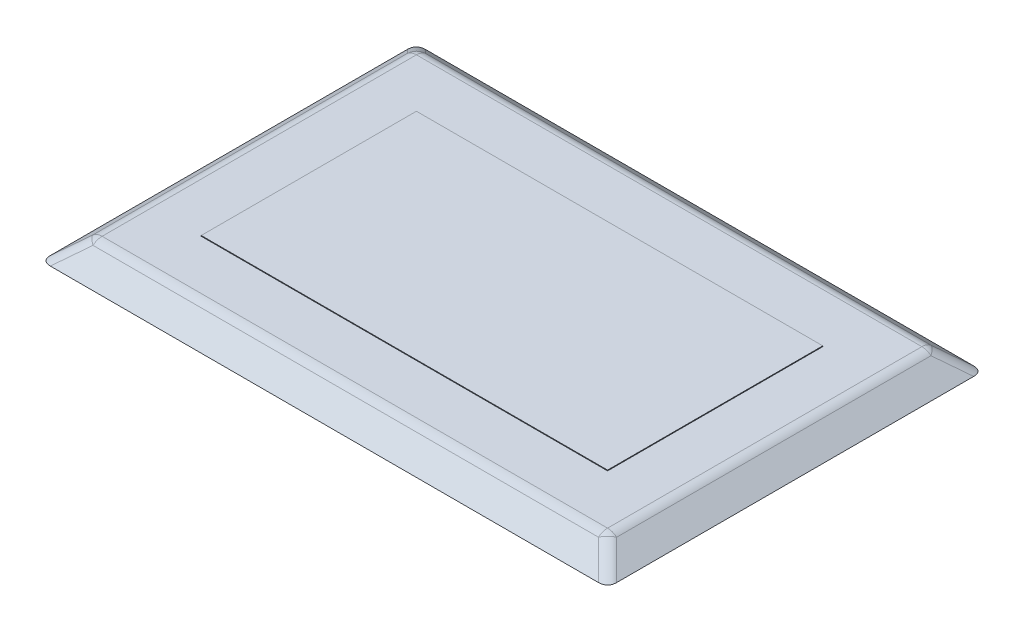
ISO-10303-21;
HEADER;
FILE_DESCRIPTION(('STEP AP214'),'2;1');
FILE_NAME('part.step','',(''),(''),'','','');
FILE_SCHEMA(('AUTOMOTIVE_DESIGN { 1 0 10303 214 1 1 1 1 }'));
ENDSEC;
DATA;
#1=APPLICATION_CONTEXT('core data for automotive mechanical design processes');
#2=APPLICATION_PROTOCOL_DEFINITION('international standard','automotive_design',2000,#1);
#3=PRODUCT_CONTEXT('',#1,'mechanical');
#4=PRODUCT('Part','Part','',(#3));
#5=PRODUCT_RELATED_PRODUCT_CATEGORY('part','',(#4));
#6=PRODUCT_DEFINITION_FORMATION('','',#4);
#7=PRODUCT_DEFINITION_CONTEXT('part definition',#1,'design');
#8=PRODUCT_DEFINITION('design','',#6,#7);
#9=PRODUCT_DEFINITION_SHAPE('','',#8);
#10=(LENGTH_UNIT() NAMED_UNIT(*) SI_UNIT(.MILLI.,.METRE.));
#11=(NAMED_UNIT(*) PLANE_ANGLE_UNIT() SI_UNIT($,.RADIAN.));
#12=(NAMED_UNIT(*) SI_UNIT($,.STERADIAN.) SOLID_ANGLE_UNIT());
#13=UNCERTAINTY_MEASURE_WITH_UNIT(LENGTH_MEASURE(1.E-05),#10,'distance_accuracy_value','');
#14=(GEOMETRIC_REPRESENTATION_CONTEXT(3) GLOBAL_UNCERTAINTY_ASSIGNED_CONTEXT((#13)) GLOBAL_UNIT_ASSIGNED_CONTEXT((#10,
#11,#12)) REPRESENTATION_CONTEXT('',''));
#15=CARTESIAN_POINT('',(0.,0.,0.));
#16=DIRECTION('',(0.,0.,1.));
#17=DIRECTION('',(1.,0.,0.));
#18=AXIS2_PLACEMENT_3D('',#15,#16,#17);
#19=CARTESIAN_POINT('',(0.,3.,0.));
#20=DIRECTION('',(0.,1.,0.));
#21=DIRECTION('',(0.,0.,1.));
#22=AXIS2_PLACEMENT_3D('',#19,#20,#21);
#23=PLANE('',#22);
#24=DIRECTION('',(0.,0.,1.));
#25=VECTOR('',#24,1.);
#26=CARTESIAN_POINT('',(-35.696798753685,3.,0.));
#27=LINE('',#26,#25);
#28=CARTESIAN_POINT('',(-35.696798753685,3.,-22.196798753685));
#29=VERTEX_POINT('',#28);
#30=CARTESIAN_POINT('',(-35.696798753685,3.,22.196798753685));
#31=VERTEX_POINT('',#30);
#32=EDGE_CURVE('E179',#29,#31,#27,.T.);
#33=ORIENTED_EDGE('',*,*,#32,.T.);
#34=DIRECTION('',(1.,0.,0.));
#35=VECTOR('',#34,1.);
#36=CARTESIAN_POINT('',(0.,3.,22.196798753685));
#37=LINE('',#36,#35);
#38=CARTESIAN_POINT('',(35.696798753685,3.,22.196798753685));
#39=VERTEX_POINT('',#38);
#40=EDGE_CURVE('E185',#31,#39,#37,.T.);
#41=ORIENTED_EDGE('',*,*,#40,.T.);
#42=DIRECTION('',(0.,0.,-1.));
#43=VECTOR('',#42,1.);
#44=CARTESIAN_POINT('',(35.696798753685,3.,0.));
#45=LINE('',#44,#43);
#46=CARTESIAN_POINT('',(35.696798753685,3.,-22.196798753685));
#47=VERTEX_POINT('',#46);
#48=EDGE_CURVE('E183',#39,#47,#45,.T.);
#49=ORIENTED_EDGE('',*,*,#48,.T.);
#50=DIRECTION('',(-1.,0.,0.));
#51=VECTOR('',#50,1.);
#52=CARTESIAN_POINT('',(0.,3.,-22.196798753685));
#53=LINE('',#52,#51);
#54=EDGE_CURVE('E181',#47,#29,#53,.T.);
#55=ORIENTED_EDGE('',*,*,#54,.T.);
#56=EDGE_LOOP('',(#33,#41,#49,#55));
#57=FACE_BOUND('',#56,.T.);
#58=DIRECTION('',(-1.,0.,0.));
#59=VECTOR('',#58,1.);
#60=CARTESIAN_POINT('',(-28.696798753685,3.,-15.196798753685));
#61=LINE('',#60,#59);
#62=CARTESIAN_POINT('',(28.696798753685,3.,-15.196798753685));
#63=VERTEX_POINT('',#62);
#64=CARTESIAN_POINT('',(-28.696798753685,3.,-15.196798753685));
#65=VERTEX_POINT('',#64);
#66=EDGE_CURVE('E503',#63,#65,#61,.T.);
#67=ORIENTED_EDGE('',*,*,#66,.F.);
#68=DIRECTION('',(0.,0.,-1.));
#69=VECTOR('',#68,1.);
#70=CARTESIAN_POINT('',(28.696798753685,3.,-15.196798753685));
#71=LINE('',#70,#69);
#72=CARTESIAN_POINT('',(28.696798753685,3.,15.196798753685));
#73=VERTEX_POINT('',#72);
#74=EDGE_CURVE('E158',#73,#63,#71,.T.);
#75=ORIENTED_EDGE('',*,*,#74,.F.);
#76=DIRECTION('',(1.,0.,0.));
#77=VECTOR('',#76,1.);
#78=CARTESIAN_POINT('',(-28.696798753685,3.,15.196798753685));
#79=LINE('',#78,#77);
#80=CARTESIAN_POINT('',(-28.696798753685,3.,15.196798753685));
#81=VERTEX_POINT('',#80);
#82=EDGE_CURVE('E154',#81,#73,#79,.T.);
#83=ORIENTED_EDGE('',*,*,#82,.F.);
#84=DIRECTION('',(0.,0.,1.));
#85=VECTOR('',#84,1.);
#86=CARTESIAN_POINT('',(-28.696798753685,3.,-15.196798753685));
#87=LINE('',#86,#85);
#88=EDGE_CURVE('E500',#65,#81,#87,.T.);
#89=ORIENTED_EDGE('',*,*,#88,.F.);
#90=EDGE_LOOP('',(#67,#75,#83,#89));
#91=FACE_BOUND('',#90,.T.);
#92=ADVANCED_FACE('F33',(#57,#91),#23,.T.);
#93=CARTESIAN_POINT('',(0.,0.,0.));
#94=DIRECTION('',(0.,1.,0.));
#95=DIRECTION('',(0.,0.,1.));
#96=AXIS2_PLACEMENT_3D('',#93,#94,#95);
#97=PLANE('',#96);
#98=DIRECTION('',(0.,0.,1.));
#99=VECTOR('',#98,1.);
#100=CARTESIAN_POINT('',(-40.,0.,-26.5));
#101=LINE('',#100,#99);
#102=CARTESIAN_POINT('',(-40.,0.,-25.2144247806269));
#103=VERTEX_POINT('',#102);
#104=CARTESIAN_POINT('',(-40.,0.,25.2144247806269));
#105=VERTEX_POINT('',#104);
#106=EDGE_CURVE('E173',#103,#105,#101,.T.);
#107=ORIENTED_EDGE('',*,*,#106,.F.);
#108=CARTESIAN_POINT('',(-36.8885523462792,0.,-23.3885523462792));
#109=DIRECTION('',(0.,1.,0.));
#110=DIRECTION('',(-0.707106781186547,0.,-0.707106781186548));
#111=AXIS2_PLACEMENT_3D('',#108,#109,#110);
#112=ELLIPSE('',#111,3.91946590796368,2.);
#113=CARTESIAN_POINT('',(-38.7144247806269,0.,-26.5));
#114=VERTEX_POINT('',#113);
#115=EDGE_CURVE('E11',#103,#114,#112,.F.);
#116=ORIENTED_EDGE('',*,*,#115,.T.);
#117=DIRECTION('',(-1.,0.,0.));
#118=VECTOR('',#117,1.);
#119=CARTESIAN_POINT('',(-40.,0.,-26.5));
#120=LINE('',#119,#118);
#121=CARTESIAN_POINT('',(38.7144247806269,0.,-26.5));
#122=VERTEX_POINT('',#121);
#123=EDGE_CURVE('E170',#122,#114,#120,.T.);
#124=ORIENTED_EDGE('',*,*,#123,.F.);
#125=CARTESIAN_POINT('',(36.8885523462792,0.,-23.3885523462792));
#126=DIRECTION('',(0.,1.,0.));
#127=DIRECTION('',(0.707106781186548,0.,-0.707106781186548));
#128=AXIS2_PLACEMENT_3D('',#125,#126,#127);
#129=ELLIPSE('',#128,3.91946590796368,2.);
#130=CARTESIAN_POINT('',(40.,0.,-25.2144247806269));
#131=VERTEX_POINT('',#130);
#132=EDGE_CURVE('E214',#122,#131,#129,.F.);
#133=ORIENTED_EDGE('',*,*,#132,.T.);
#134=DIRECTION('',(0.,0.,-1.));
#135=VECTOR('',#134,1.);
#136=CARTESIAN_POINT('',(40.,0.,-26.5));
#137=LINE('',#136,#135);
#138=CARTESIAN_POINT('',(40.,0.,25.2144247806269));
#139=VERTEX_POINT('',#138);
#140=EDGE_CURVE('E167',#139,#131,#137,.T.);
#141=ORIENTED_EDGE('',*,*,#140,.F.);
#142=CARTESIAN_POINT('',(36.8885523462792,0.,23.3885523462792));
#143=DIRECTION('',(0.,1.,0.));
#144=DIRECTION('',(-0.707106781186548,0.,-0.707106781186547));
#145=AXIS2_PLACEMENT_3D('',#142,#143,#144);
#146=ELLIPSE('',#145,3.91946590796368,2.);
#147=CARTESIAN_POINT('',(38.7144247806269,0.,26.5));
#148=VERTEX_POINT('',#147);
#149=EDGE_CURVE('E212',#139,#148,#146,.F.);
#150=ORIENTED_EDGE('',*,*,#149,.T.);
#151=DIRECTION('',(1.,0.,0.));
#152=VECTOR('',#151,1.);
#153=CARTESIAN_POINT('',(-40.,0.,26.5));
#154=LINE('',#153,#152);
#155=CARTESIAN_POINT('',(-38.7144247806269,0.,26.5));
#156=VERTEX_POINT('',#155);
#157=EDGE_CURVE('E176',#156,#148,#154,.T.);
#158=ORIENTED_EDGE('',*,*,#157,.F.);
#159=CARTESIAN_POINT('',(-36.8885523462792,0.,23.3885523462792));
#160=DIRECTION('',(0.,1.,0.));
#161=DIRECTION('',(0.707106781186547,0.,-0.707106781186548));
#162=AXIS2_PLACEMENT_3D('',#159,#160,#161);
#163=ELLIPSE('',#162,3.91946590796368,2.);
#164=EDGE_CURVE('E42',#156,#105,#163,.F.);
#165=ORIENTED_EDGE('',*,*,#164,.T.);
#166=EDGE_LOOP('',(#107,#116,#124,#133,#141,#150,#158,#165));
#167=FACE_BOUND('',#166,.T.);
#168=ADVANCED_FACE('F279',(#167),#97,.F.);
#169=CARTESIAN_POINT('',(36.4247392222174,3.,0.));
#170=DIRECTION('',(0.642787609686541,0.766044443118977,0.));
#171=DIRECTION('',(0.,0.,1.));
#172=AXIS2_PLACEMENT_3D('',#169,#170,#171);
#173=PLANE('',#172);
#174=ORIENTED_EDGE('',*,*,#140,.T.);
#175=DIRECTION('',(0.608120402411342,-0.510273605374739,-0.608120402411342));
#176=VECTOR('',#175,1.);
#177=CARTESIAN_POINT('',(28.4223508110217,9.71480116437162,-13.6367755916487));
#178=LINE('',#177,#176);
#179=CARTESIAN_POINT('',(36.982373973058,2.53208888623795,-22.196798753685));
#180=VERTEX_POINT('',#179);
#181=EDGE_CURVE('E199',#131,#180,#178,.F.);
#182=ORIENTED_EDGE('',*,*,#181,.T.);
#183=DIRECTION('',(0.,0.,-1.));
#184=VECTOR('',#183,1.);
#185=CARTESIAN_POINT('',(36.9823739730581,2.53208888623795,0.));
#186=LINE('',#185,#184);
#187=CARTESIAN_POINT('',(36.9823739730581,2.53208888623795,22.196798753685));
#188=VERTEX_POINT('',#187);
#189=EDGE_CURVE('E197',#180,#188,#186,.F.);
#190=ORIENTED_EDGE('',*,*,#189,.T.);
#191=DIRECTION('',(-0.608120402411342,0.510273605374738,-0.608120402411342));
#192=VECTOR('',#191,1.);
#193=CARTESIAN_POINT('',(28.4223508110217,9.71480116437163,13.6367755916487));
#194=LINE('',#193,#192);
#195=EDGE_CURVE('E195',#188,#139,#194,.F.);
#196=ORIENTED_EDGE('',*,*,#195,.T.);
#197=EDGE_LOOP('',(#174,#182,#190,#196));
#198=FACE_BOUND('',#197,.T.);
#199=ADVANCED_FACE('F282',(#198),#173,.T.);
#200=CARTESIAN_POINT('',(0.,3.,-22.9247392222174));
#201=DIRECTION('',(0.,0.766044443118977,-0.642787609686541));
#202=DIRECTION('',(1.,0.,0.));
#203=AXIS2_PLACEMENT_3D('',#200,#201,#202);
#204=PLANE('',#203);
#205=ORIENTED_EDGE('',*,*,#123,.T.);
#206=DIRECTION('',(-0.608120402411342,-0.510273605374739,-0.608120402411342));
#207=VECTOR('',#206,1.);
#208=CARTESIAN_POINT('',(-22.1443348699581,13.9039563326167,-9.92991008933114));
#209=LINE('',#208,#207);
#210=CARTESIAN_POINT('',(-35.696798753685,2.53208888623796,-23.482373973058));
#211=VERTEX_POINT('',#210);
#212=EDGE_CURVE('E205',#114,#211,#209,.F.);
#213=ORIENTED_EDGE('',*,*,#212,.T.);
#214=DIRECTION('',(-1.,0.,0.));
#215=VECTOR('',#214,1.);
#216=CARTESIAN_POINT('',(0.,2.53208888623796,-23.482373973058));
#217=LINE('',#216,#215);
#218=CARTESIAN_POINT('',(35.696798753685,2.53208888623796,-23.482373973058));
#219=VERTEX_POINT('',#218);
#220=EDGE_CURVE('E203',#211,#219,#217,.F.);
#221=ORIENTED_EDGE('',*,*,#220,.T.);
#222=DIRECTION('',(0.608120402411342,-0.510273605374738,-0.608120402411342));
#223=VECTOR('',#222,1.);
#224=CARTESIAN_POINT('',(22.1443348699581,13.9039563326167,-9.92991008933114));
#225=LINE('',#224,#223);
#226=EDGE_CURVE('E201',#219,#122,#225,.T.);
#227=ORIENTED_EDGE('',*,*,#226,.T.);
#228=EDGE_LOOP('',(#205,#213,#221,#227));
#229=FACE_BOUND('',#228,.T.);
#230=ADVANCED_FACE('F268',(#229),#204,.T.);
#231=CARTESIAN_POINT('',(0.,3.,22.9247392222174));
#232=DIRECTION('',(0.,0.766044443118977,0.642787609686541));
#233=DIRECTION('',(-1.,0.,0.));
#234=AXIS2_PLACEMENT_3D('',#231,#232,#233);
#235=PLANE('',#234);
#236=DIRECTION('',(1.,0.,0.));
#237=VECTOR('',#236,1.);
#238=CARTESIAN_POINT('',(0.,2.53208888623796,23.482373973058));
#239=LINE('',#238,#237);
#240=CARTESIAN_POINT('',(35.696798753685,2.53208888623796,23.482373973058));
#241=VERTEX_POINT('',#240);
#242=CARTESIAN_POINT('',(-35.696798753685,2.53208888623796,23.482373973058));
#243=VERTEX_POINT('',#242);
#244=EDGE_CURVE('E190',#241,#243,#239,.F.);
#245=ORIENTED_EDGE('',*,*,#244,.T.);
#246=DIRECTION('',(0.608120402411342,0.510273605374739,-0.608120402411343));
#247=VECTOR('',#246,1.);
#248=CARTESIAN_POINT('',(-22.1443348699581,13.9039563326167,9.92991008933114));
#249=LINE('',#248,#247);
#250=EDGE_CURVE('E193',#243,#156,#249,.F.);
#251=ORIENTED_EDGE('',*,*,#250,.T.);
#252=ORIENTED_EDGE('',*,*,#157,.T.);
#253=DIRECTION('',(-0.608120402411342,0.510273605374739,-0.608120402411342));
#254=VECTOR('',#253,1.);
#255=CARTESIAN_POINT('',(22.1443348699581,13.9039563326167,9.92991008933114));
#256=LINE('',#255,#254);
#257=EDGE_CURVE('E188',#148,#241,#256,.T.);
#258=ORIENTED_EDGE('',*,*,#257,.T.);
#259=EDGE_LOOP('',(#245,#251,#252,#258));
#260=FACE_BOUND('',#259,.T.);
#261=ADVANCED_FACE('F299',(#260),#235,.T.);
#262=CARTESIAN_POINT('',(-36.4247392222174,3.,0.));
#263=DIRECTION('',(-0.642787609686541,0.766044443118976,0.));
#264=DIRECTION('',(0.,0.,-1.));
#265=AXIS2_PLACEMENT_3D('',#262,#263,#264);
#266=PLANE('',#265);
#267=DIRECTION('',(0.,0.,1.));
#268=VECTOR('',#267,1.);
#269=CARTESIAN_POINT('',(-36.9823739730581,2.53208888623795,0.));
#270=LINE('',#269,#268);
#271=CARTESIAN_POINT('',(-36.9823739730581,2.53208888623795,22.196798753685));
#272=VERTEX_POINT('',#271);
#273=CARTESIAN_POINT('',(-36.9823739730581,2.53208888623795,-22.196798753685));
#274=VERTEX_POINT('',#273);
#275=EDGE_CURVE('E58',#272,#274,#270,.F.);
#276=ORIENTED_EDGE('',*,*,#275,.T.);
#277=DIRECTION('',(-0.608120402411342,-0.510273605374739,-0.608120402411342));
#278=VECTOR('',#277,1.);
#279=CARTESIAN_POINT('',(-28.4223508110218,9.71480116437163,-13.6367755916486));
#280=LINE('',#279,#278);
#281=EDGE_CURVE('E210',#274,#103,#280,.T.);
#282=ORIENTED_EDGE('',*,*,#281,.T.);
#283=ORIENTED_EDGE('',*,*,#106,.T.);
#284=DIRECTION('',(0.608120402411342,0.510273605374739,-0.608120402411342));
#285=VECTOR('',#284,1.);
#286=CARTESIAN_POINT('',(-28.4223508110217,9.71480116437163,13.6367755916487));
#287=LINE('',#286,#285);
#288=EDGE_CURVE('E207',#105,#272,#287,.T.);
#289=ORIENTED_EDGE('',*,*,#288,.T.);
#290=EDGE_LOOP('',(#276,#282,#283,#289));
#291=FACE_BOUND('',#290,.T.);
#292=ADVANCED_FACE('F306',(#291),#266,.T.);
#293=CARTESIAN_POINT('',(-27.1367755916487,8.18271227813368,-13.6367755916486));
#294=DIRECTION('',(-0.608120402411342,-0.510273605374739,-0.608120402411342));
#295=DIRECTION('',(-0.707106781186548,0.,0.707106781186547));
#296=AXIS2_PLACEMENT_3D('',#293,#294,#295);
#297=CYLINDRICAL_SURFACE('',#296,2.);
#298=ORIENTED_EDGE('',*,*,#115,.F.);
#299=ORIENTED_EDGE('',*,*,#281,.F.);
#300=CARTESIAN_POINT('',(-35.696798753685,1.,-22.196798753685));
#301=DIRECTION('',(0.608120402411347,0.510273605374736,0.608120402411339));
#302=DIRECTION('',(0.707106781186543,0.,-0.707106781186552));
#303=AXIS2_PLACEMENT_3D('',#300,#301,#302);
#304=CIRCLE('',#303,2.);
#305=EDGE_CURVE('E37',#211,#274,#304,.T.);
#306=ORIENTED_EDGE('',*,*,#305,.F.);
#307=ORIENTED_EDGE('',*,*,#212,.F.);
#308=EDGE_LOOP('',(#298,#299,#306,#307));
#309=FACE_BOUND('',#308,.T.);
#310=ADVANCED_FACE('F35',(#309),#297,.T.);
#311=CARTESIAN_POINT('',(0.,1.,-22.196798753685));
#312=DIRECTION('',(-1.,0.,0.));
#313=DIRECTION('',(0.,0.,1.));
#314=AXIS2_PLACEMENT_3D('',#311,#312,#313);
#315=CYLINDRICAL_SURFACE('',#314,2.);
#316=CARTESIAN_POINT('',(35.696798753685,1.,-22.196798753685));
#317=DIRECTION('',(1.,0.,0.));
#318=DIRECTION('',(0.,0.,-1.));
#319=AXIS2_PLACEMENT_3D('',#316,#317,#318);
#320=CIRCLE('',#319,2.);
#321=EDGE_CURVE('E239',#219,#47,#320,.T.);
#322=ORIENTED_EDGE('',*,*,#321,.F.);
#323=ORIENTED_EDGE('',*,*,#220,.F.);
#324=CARTESIAN_POINT('',(-35.696798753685,1.,-22.196798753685));
#325=DIRECTION('',(-1.,0.,0.));
#326=DIRECTION('',(0.,0.,1.));
#327=AXIS2_PLACEMENT_3D('',#324,#325,#326);
#328=CIRCLE('',#327,2.);
#329=EDGE_CURVE('E241',#29,#211,#328,.T.);
#330=ORIENTED_EDGE('',*,*,#329,.F.);
#331=ORIENTED_EDGE('',*,*,#54,.F.);
#332=EDGE_LOOP('',(#322,#323,#330,#331));
#333=FACE_BOUND('',#332,.T.);
#334=ADVANCED_FACE('F265',(#333),#315,.T.);
#335=CARTESIAN_POINT('',(22.1443348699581,12.3718674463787,-8.64433486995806));
#336=DIRECTION('',(0.608120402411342,-0.510273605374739,-0.608120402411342));
#337=DIRECTION('',(-0.707106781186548,0.,-0.707106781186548));
#338=AXIS2_PLACEMENT_3D('',#335,#336,#337);
#339=CYLINDRICAL_SURFACE('',#338,2.);
#340=ORIENTED_EDGE('',*,*,#132,.F.);
#341=ORIENTED_EDGE('',*,*,#226,.F.);
#342=CARTESIAN_POINT('',(35.696798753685,0.999999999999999,-22.196798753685));
#343=DIRECTION('',(-0.608120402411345,0.510273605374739,0.608120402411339));
#344=DIRECTION('',(0.707106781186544,0.,0.707106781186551));
#345=AXIS2_PLACEMENT_3D('',#342,#343,#344);
#346=CIRCLE('',#345,2.);
#347=EDGE_CURVE('E236',#180,#219,#346,.T.);
#348=ORIENTED_EDGE('',*,*,#347,.F.);
#349=ORIENTED_EDGE('',*,*,#181,.F.);
#350=EDGE_LOOP('',(#340,#341,#348,#349));
#351=FACE_BOUND('',#350,.T.);
#352=ADVANCED_FACE('F273',(#351),#339,.T.);
#353=CARTESIAN_POINT('',(-35.696798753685,1.,-22.196798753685));
#354=DIRECTION('',(0.,0.,1.));
#355=DIRECTION('',(1.,0.,0.));
#356=AXIS2_PLACEMENT_3D('',#353,#354,#355);
#357=SPHERICAL_SURFACE('',#356,2.);
#358=ORIENTED_EDGE('',*,*,#329,.T.);
#359=ORIENTED_EDGE('',*,*,#305,.T.);
#360=CARTESIAN_POINT('',(-35.696798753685,1.,-22.196798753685));
#361=DIRECTION('',(0.,0.,-1.));
#362=DIRECTION('',(-1.,0.,0.));
#363=AXIS2_PLACEMENT_3D('',#360,#361,#362);
#364=CIRCLE('',#363,2.);
#365=EDGE_CURVE('E233',#29,#274,#364,.F.);
#366=ORIENTED_EDGE('',*,*,#365,.F.);
#367=EDGE_LOOP('',(#358,#359,#366));
#368=FACE_BOUND('',#367,.T.);
#369=ADVANCED_FACE('F248',(#368),#357,.T.);
#370=CARTESIAN_POINT('',(35.696798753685,1.,-22.196798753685));
#371=DIRECTION('',(0.,0.,1.));
#372=DIRECTION('',(1.,0.,0.));
#373=AXIS2_PLACEMENT_3D('',#370,#371,#372);
#374=SPHERICAL_SURFACE('',#373,2.);
#375=ORIENTED_EDGE('',*,*,#347,.T.);
#376=ORIENTED_EDGE('',*,*,#321,.T.);
#377=CARTESIAN_POINT('',(35.696798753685,1.,-22.196798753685));
#378=DIRECTION('',(0.,0.,-1.));
#379=DIRECTION('',(-1.,0.,0.));
#380=AXIS2_PLACEMENT_3D('',#377,#378,#379);
#381=CIRCLE('',#380,2.);
#382=EDGE_CURVE('E230',#180,#47,#381,.F.);
#383=ORIENTED_EDGE('',*,*,#382,.F.);
#384=EDGE_LOOP('',(#375,#376,#383));
#385=FACE_BOUND('',#384,.T.);
#386=ADVANCED_FACE('F345',(#385),#374,.T.);
#387=CARTESIAN_POINT('',(-27.1367755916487,8.18271227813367,13.6367755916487));
#388=DIRECTION('',(0.608120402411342,0.510273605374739,-0.608120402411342));
#389=DIRECTION('',(-0.707106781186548,0.,-0.707106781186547));
#390=AXIS2_PLACEMENT_3D('',#387,#388,#389);
#391=CYLINDRICAL_SURFACE('',#390,2.);
#392=ORIENTED_EDGE('',*,*,#164,.F.);
#393=ORIENTED_EDGE('',*,*,#250,.F.);
#394=CARTESIAN_POINT('',(-35.696798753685,1.,22.196798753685));
#395=DIRECTION('',(0.608120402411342,0.510273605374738,-0.608120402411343));
#396=DIRECTION('',(-0.707106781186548,0.,-0.707106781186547));
#397=AXIS2_PLACEMENT_3D('',#394,#395,#396);
#398=CIRCLE('',#397,2.);
#399=EDGE_CURVE('E227',#272,#243,#398,.T.);
#400=ORIENTED_EDGE('',*,*,#399,.F.);
#401=ORIENTED_EDGE('',*,*,#288,.F.);
#402=EDGE_LOOP('',(#392,#393,#400,#401));
#403=FACE_BOUND('',#402,.T.);
#404=ADVANCED_FACE('F305',(#403),#391,.T.);
#405=CARTESIAN_POINT('',(-35.696798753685,1.,0.));
#406=DIRECTION('',(0.,0.,1.));
#407=DIRECTION('',(1.,0.,0.));
#408=AXIS2_PLACEMENT_3D('',#405,#406,#407);
#409=CYLINDRICAL_SURFACE('',#408,2.);
#410=ORIENTED_EDGE('',*,*,#365,.T.);
#411=ORIENTED_EDGE('',*,*,#275,.F.);
#412=CARTESIAN_POINT('',(-35.696798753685,1.,22.196798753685));
#413=DIRECTION('',(0.,0.,1.));
#414=DIRECTION('',(1.,0.,0.));
#415=AXIS2_PLACEMENT_3D('',#412,#413,#414);
#416=CIRCLE('',#415,2.);
#417=EDGE_CURVE('E224',#31,#272,#416,.T.);
#418=ORIENTED_EDGE('',*,*,#417,.F.);
#419=ORIENTED_EDGE('',*,*,#32,.F.);
#420=EDGE_LOOP('',(#410,#411,#418,#419));
#421=FACE_BOUND('',#420,.T.);
#422=ADVANCED_FACE('F253',(#421),#409,.T.);
#423=CARTESIAN_POINT('',(35.696798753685,1.,0.));
#424=DIRECTION('',(0.,0.,-1.));
#425=DIRECTION('',(-1.,0.,0.));
#426=AXIS2_PLACEMENT_3D('',#423,#424,#425);
#427=CYLINDRICAL_SURFACE('',#426,2.);
#428=ORIENTED_EDGE('',*,*,#382,.T.);
#429=ORIENTED_EDGE('',*,*,#48,.F.);
#430=CARTESIAN_POINT('',(35.696798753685,0.999999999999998,22.196798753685));
#431=DIRECTION('',(0.,0.,1.));
#432=DIRECTION('',(1.,0.,0.));
#433=AXIS2_PLACEMENT_3D('',#430,#431,#432);
#434=CIRCLE('',#433,2.);
#435=EDGE_CURVE('E221',#188,#39,#434,.T.);
#436=ORIENTED_EDGE('',*,*,#435,.F.);
#437=ORIENTED_EDGE('',*,*,#189,.F.);
#438=EDGE_LOOP('',(#428,#429,#436,#437));
#439=FACE_BOUND('',#438,.T.);
#440=ADVANCED_FACE('F292',(#439),#427,.T.);
#441=CARTESIAN_POINT('',(22.1443348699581,12.3718674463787,8.64433486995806));
#442=DIRECTION('',(-0.608120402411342,0.510273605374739,-0.608120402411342));
#443=DIRECTION('',(-0.707106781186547,0.,0.707106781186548));
#444=AXIS2_PLACEMENT_3D('',#441,#442,#443);
#445=CYLINDRICAL_SURFACE('',#444,2.);
#446=ORIENTED_EDGE('',*,*,#149,.F.);
#447=ORIENTED_EDGE('',*,*,#195,.F.);
#448=CARTESIAN_POINT('',(35.696798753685,1.,22.196798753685));
#449=DIRECTION('',(-0.608120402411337,0.510273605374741,-0.608120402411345));
#450=DIRECTION('',(-0.707106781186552,0.,0.707106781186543));
#451=AXIS2_PLACEMENT_3D('',#448,#449,#450);
#452=CIRCLE('',#451,2.);
#453=EDGE_CURVE('E218',#241,#188,#452,.T.);
#454=ORIENTED_EDGE('',*,*,#453,.F.);
#455=ORIENTED_EDGE('',*,*,#257,.F.);
#456=EDGE_LOOP('',(#446,#447,#454,#455));
#457=FACE_BOUND('',#456,.T.);
#458=ADVANCED_FACE('F288',(#457),#445,.T.);
#459=CARTESIAN_POINT('',(-35.696798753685,1.,22.196798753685));
#460=DIRECTION('',(0.,0.,1.));
#461=DIRECTION('',(1.,0.,0.));
#462=AXIS2_PLACEMENT_3D('',#459,#460,#461);
#463=SPHERICAL_SURFACE('',#462,2.);
#464=ORIENTED_EDGE('',*,*,#417,.T.);
#465=ORIENTED_EDGE('',*,*,#399,.T.);
#466=CARTESIAN_POINT('',(-35.696798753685,1.,22.196798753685));
#467=DIRECTION('',(-1.,0.,0.));
#468=DIRECTION('',(0.,0.,1.));
#469=AXIS2_PLACEMENT_3D('',#466,#467,#468);
#470=CIRCLE('',#469,2.);
#471=EDGE_CURVE('E162',#31,#243,#470,.F.);
#472=ORIENTED_EDGE('',*,*,#471,.F.);
#473=EDGE_LOOP('',(#464,#465,#472));
#474=FACE_BOUND('',#473,.T.);
#475=ADVANCED_FACE('F333',(#474),#463,.T.);
#476=CARTESIAN_POINT('',(35.696798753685,1.,22.196798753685));
#477=DIRECTION('',(0.,0.,1.));
#478=DIRECTION('',(1.,0.,0.));
#479=AXIS2_PLACEMENT_3D('',#476,#477,#478);
#480=SPHERICAL_SURFACE('',#479,2.);
#481=ORIENTED_EDGE('',*,*,#453,.T.);
#482=ORIENTED_EDGE('',*,*,#435,.T.);
#483=CARTESIAN_POINT('',(35.696798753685,1.,22.196798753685));
#484=DIRECTION('',(1.,0.,0.));
#485=DIRECTION('',(0.,0.,-1.));
#486=AXIS2_PLACEMENT_3D('',#483,#484,#485);
#487=CIRCLE('',#486,2.);
#488=EDGE_CURVE('E160',#241,#39,#487,.F.);
#489=ORIENTED_EDGE('',*,*,#488,.F.);
#490=EDGE_LOOP('',(#481,#482,#489));
#491=FACE_BOUND('',#490,.T.);
#492=ADVANCED_FACE('F295',(#491),#480,.T.);
#493=CARTESIAN_POINT('',(0.,1.,22.196798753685));
#494=DIRECTION('',(1.,0.,0.));
#495=DIRECTION('',(0.,0.,-1.));
#496=AXIS2_PLACEMENT_3D('',#493,#494,#495);
#497=CYLINDRICAL_SURFACE('',#496,2.);
#498=ORIENTED_EDGE('',*,*,#471,.T.);
#499=ORIENTED_EDGE('',*,*,#244,.F.);
#500=ORIENTED_EDGE('',*,*,#488,.T.);
#501=ORIENTED_EDGE('',*,*,#40,.F.);
#502=EDGE_LOOP('',(#498,#499,#500,#501));
#503=FACE_BOUND('',#502,.T.);
#504=ADVANCED_FACE('F297',(#503),#497,.T.);
#505=CARTESIAN_POINT('',(28.696798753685,3.1,-15.196798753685));
#506=DIRECTION('',(-1.,0.,0.));
#507=DIRECTION('',(0.,0.,1.));
#508=AXIS2_PLACEMENT_3D('',#505,#506,#507);
#509=PLANE('',#508);
#510=ORIENTED_EDGE('',*,*,#74,.T.);
#511=DIRECTION('',(0.,-1.,0.));
#512=VECTOR('',#511,1.);
#513=CARTESIAN_POINT('',(28.696798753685,3.1,-15.196798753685));
#514=LINE('',#513,#512);
#515=CARTESIAN_POINT('',(28.696798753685,3.1,-15.196798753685));
#516=VERTEX_POINT('',#515);
#517=EDGE_CURVE('E139',#516,#63,#514,.T.);
#518=ORIENTED_EDGE('',*,*,#517,.F.);
#519=DIRECTION('',(0.,0.,-1.));
#520=VECTOR('',#519,1.);
#521=CARTESIAN_POINT('',(28.696798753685,3.1,-15.196798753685));
#522=LINE('',#521,#520);
#523=CARTESIAN_POINT('',(28.696798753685,3.1,15.196798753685));
#524=VERTEX_POINT('',#523);
#525=EDGE_CURVE('E146',#524,#516,#522,.T.);
#526=ORIENTED_EDGE('',*,*,#525,.F.);
#527=DIRECTION('',(0.,-1.,0.));
#528=VECTOR('',#527,1.);
#529=CARTESIAN_POINT('',(28.696798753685,3.1,15.196798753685));
#530=LINE('',#529,#528);
#531=EDGE_CURVE('E498',#524,#73,#530,.T.);
#532=ORIENTED_EDGE('',*,*,#531,.T.);
#533=EDGE_LOOP('',(#510,#518,#526,#532));
#534=FACE_BOUND('',#533,.T.);
#535=ADVANCED_FACE('F156',(#534),#509,.F.);
#536=CARTESIAN_POINT('',(-28.696798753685,3.1,-15.196798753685));
#537=DIRECTION('',(0.,0.,1.));
#538=DIRECTION('',(1.,0.,0.));
#539=AXIS2_PLACEMENT_3D('',#536,#537,#538);
#540=PLANE('',#539);
#541=ORIENTED_EDGE('',*,*,#66,.T.);
#542=DIRECTION('',(0.,-1.,0.));
#543=VECTOR('',#542,1.);
#544=CARTESIAN_POINT('',(-28.696798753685,3.1,-15.196798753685));
#545=LINE('',#544,#543);
#546=CARTESIAN_POINT('',(-28.696798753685,3.1,-15.196798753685));
#547=VERTEX_POINT('',#546);
#548=EDGE_CURVE('E142',#547,#65,#545,.T.);
#549=ORIENTED_EDGE('',*,*,#548,.F.);
#550=DIRECTION('',(-1.,0.,0.));
#551=VECTOR('',#550,1.);
#552=CARTESIAN_POINT('',(-28.696798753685,3.1,-15.196798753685));
#553=LINE('',#552,#551);
#554=EDGE_CURVE('E135',#516,#547,#553,.T.);
#555=ORIENTED_EDGE('',*,*,#554,.F.);
#556=ORIENTED_EDGE('',*,*,#517,.T.);
#557=EDGE_LOOP('',(#541,#549,#555,#556));
#558=FACE_BOUND('',#557,.T.);
#559=ADVANCED_FACE('F137',(#558),#540,.F.);
#560=CARTESIAN_POINT('',(-28.696798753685,3.1,-15.196798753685));
#561=DIRECTION('',(1.,0.,0.));
#562=DIRECTION('',(0.,0.,-1.));
#563=AXIS2_PLACEMENT_3D('',#560,#561,#562);
#564=PLANE('',#563);
#565=ORIENTED_EDGE('',*,*,#88,.T.);
#566=DIRECTION('',(0.,-1.,0.));
#567=VECTOR('',#566,1.);
#568=CARTESIAN_POINT('',(-28.696798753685,3.1,15.196798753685));
#569=LINE('',#568,#567);
#570=CARTESIAN_POINT('',(-28.696798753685,3.1,15.196798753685));
#571=VERTEX_POINT('',#570);
#572=EDGE_CURVE('E50',#571,#81,#569,.T.);
#573=ORIENTED_EDGE('',*,*,#572,.F.);
#574=DIRECTION('',(0.,0.,1.));
#575=VECTOR('',#574,1.);
#576=CARTESIAN_POINT('',(-28.696798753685,3.1,-15.196798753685));
#577=LINE('',#576,#575);
#578=EDGE_CURVE('E145',#547,#571,#577,.T.);
#579=ORIENTED_EDGE('',*,*,#578,.F.);
#580=ORIENTED_EDGE('',*,*,#548,.T.);
#581=EDGE_LOOP('',(#565,#573,#579,#580));
#582=FACE_BOUND('',#581,.T.);
#583=ADVANCED_FACE('F403',(#582),#564,.F.);
#584=CARTESIAN_POINT('',(-28.696798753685,3.1,15.196798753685));
#585=DIRECTION('',(0.,0.,-1.));
#586=DIRECTION('',(-1.,0.,0.));
#587=AXIS2_PLACEMENT_3D('',#584,#585,#586);
#588=PLANE('',#587);
#589=ORIENTED_EDGE('',*,*,#82,.T.);
#590=ORIENTED_EDGE('',*,*,#531,.F.);
#591=DIRECTION('',(1.,0.,0.));
#592=VECTOR('',#591,1.);
#593=CARTESIAN_POINT('',(-28.696798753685,3.1,15.196798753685));
#594=LINE('',#593,#592);
#595=EDGE_CURVE('E150',#571,#524,#594,.T.);
#596=ORIENTED_EDGE('',*,*,#595,.F.);
#597=ORIENTED_EDGE('',*,*,#572,.T.);
#598=EDGE_LOOP('',(#589,#590,#596,#597));
#599=FACE_BOUND('',#598,.T.);
#600=ADVANCED_FACE('F409',(#599),#588,.F.);
#601=CARTESIAN_POINT('',(0.,3.1,0.));
#602=DIRECTION('',(0.,1.,0.));
#603=DIRECTION('',(0.,0.,1.));
#604=AXIS2_PLACEMENT_3D('',#601,#602,#603);
#605=PLANE('',#604);
#606=ORIENTED_EDGE('',*,*,#525,.T.);
#607=ORIENTED_EDGE('',*,*,#554,.T.);
#608=ORIENTED_EDGE('',*,*,#578,.T.);
#609=ORIENTED_EDGE('',*,*,#595,.T.);
#610=EDGE_LOOP('',(#606,#607,#608,#609));
#611=FACE_BOUND('',#610,.T.);
#612=ADVANCED_FACE('F149',(#611),#605,.T.);
#613=CLOSED_SHELL('',(#92,#168,#199,#230,#261,#292,#310,#334,#352,#369,#386,#404,#422,#440,#458,
#475,#492,#504,#535,#559,#583,#600,#612));
#614=MANIFOLD_SOLID_BREP('B2',#613);
#615=ADVANCED_BREP_SHAPE_REPRESENTATION('',(#18,#614),#14);
#616=SHAPE_DEFINITION_REPRESENTATION(#9,#615);
ENDSEC;
END-ISO-10303-21;
